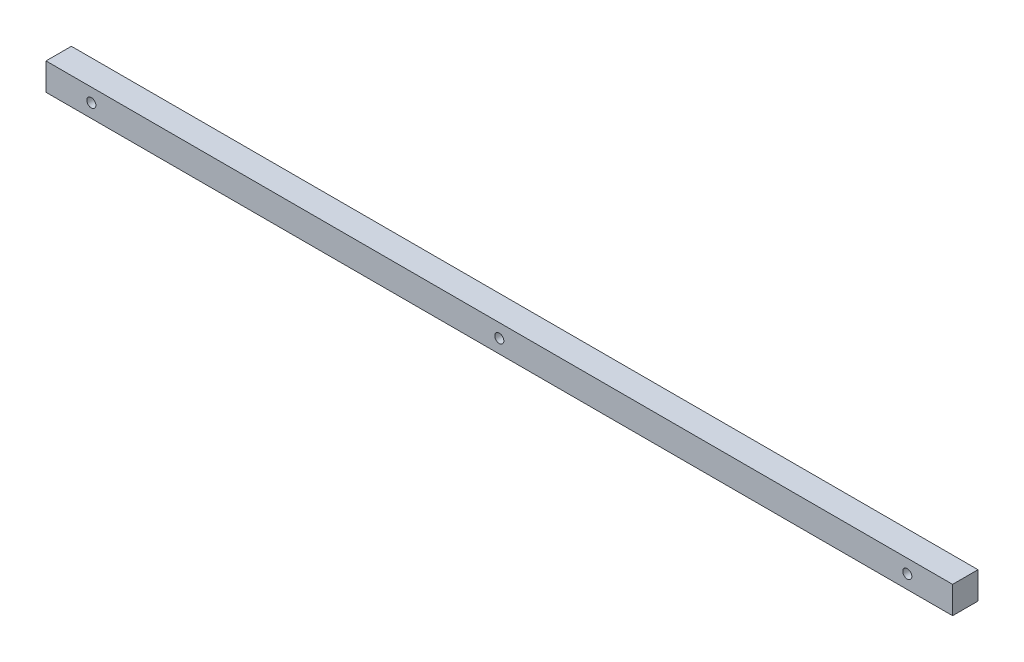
from build123d import *

# Parameters (mm, degrees)
SKETCH_1_W      = 1000
SKETCH_1_H      = 30
SKETCH_1_R      = 5
EXTRUDE_1_DEPTH = 28


with BuildPart() as part:
    # Sketch 1 → Extrude 1 (new body)
    with BuildSketch(Plane.XY):
        Rectangle(SKETCH_1_W, SKETCH_1_H)
        with Locations((450, 0)):
            Circle(SKETCH_1_R, mode=Mode.SUBTRACT)
        with Locations((-450, 0)):
            Circle(SKETCH_1_R, mode=Mode.SUBTRACT)
        Circle(SKETCH_1_R, mode=Mode.SUBTRACT)
    extrude(amount=EXTRUDE_1_DEPTH)


solid = part.part
